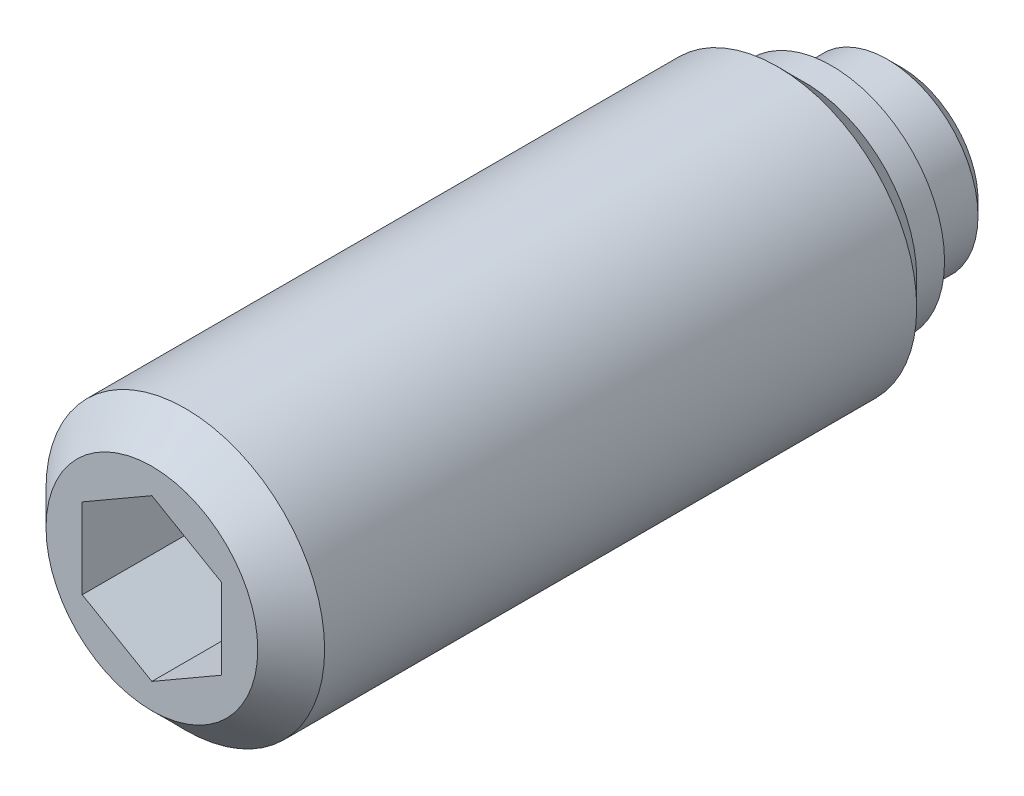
ISO-10303-21;
HEADER;
FILE_DESCRIPTION(('STEP AP214'),'2;1');
FILE_NAME('part.step','',(''),(''),'','','');
FILE_SCHEMA(('AUTOMOTIVE_DESIGN { 1 0 10303 214 1 1 1 1 }'));
ENDSEC;
DATA;
#1=APPLICATION_CONTEXT('core data for automotive mechanical design processes');
#2=APPLICATION_PROTOCOL_DEFINITION('international standard','automotive_design',2000,#1);
#3=PRODUCT_CONTEXT('',#1,'mechanical');
#4=PRODUCT('Part','Part','',(#3));
#5=PRODUCT_RELATED_PRODUCT_CATEGORY('part','',(#4));
#6=PRODUCT_DEFINITION_FORMATION('','',#4);
#7=PRODUCT_DEFINITION_CONTEXT('part definition',#1,'design');
#8=PRODUCT_DEFINITION('design','',#6,#7);
#9=PRODUCT_DEFINITION_SHAPE('','',#8);
#10=(LENGTH_UNIT() NAMED_UNIT(*) SI_UNIT(.MILLI.,.METRE.));
#11=(NAMED_UNIT(*) PLANE_ANGLE_UNIT() SI_UNIT($,.RADIAN.));
#12=(NAMED_UNIT(*) SI_UNIT($,.STERADIAN.) SOLID_ANGLE_UNIT());
#13=UNCERTAINTY_MEASURE_WITH_UNIT(LENGTH_MEASURE(1.E-05),#10,'distance_accuracy_value','');
#14=(GEOMETRIC_REPRESENTATION_CONTEXT(3) GLOBAL_UNCERTAINTY_ASSIGNED_CONTEXT((#13)) GLOBAL_UNIT_ASSIGNED_CONTEXT((#10,
#11,#12)) REPRESENTATION_CONTEXT('',''));
#15=CARTESIAN_POINT('',(0.,0.,0.));
#16=DIRECTION('',(0.,0.,1.));
#17=DIRECTION('',(1.,0.,0.));
#18=AXIS2_PLACEMENT_3D('',#15,#16,#17);
#19=CARTESIAN_POINT('',(0.,0.,0.));
#20=DIRECTION('',(0.,0.,-1.));
#21=DIRECTION('',(-1.,0.,0.));
#22=AXIS2_PLACEMENT_3D('',#19,#20,#21);
#23=CYLINDRICAL_SURFACE('',#22,3.25);
#24=CARTESIAN_POINT('',(0.,0.,0.5));
#25=DIRECTION('',(0.,0.,-1.));
#26=DIRECTION('',(-1.,0.,0.));
#27=AXIS2_PLACEMENT_3D('',#24,#25,#26);
#28=CIRCLE('',#27,3.25);
#29=CARTESIAN_POINT('',(-3.25,0.,0.5));
#30=VERTEX_POINT('',#29);
#31=EDGE_CURVE('E133',#30,#30,#28,.T.);
#32=ORIENTED_EDGE('',*,*,#31,.F.);
#33=EDGE_LOOP('',(#32));
#34=FACE_BOUND('',#33,.T.);
#35=CARTESIAN_POINT('',(0.,0.,2.5));
#36=DIRECTION('',(0.,0.,-1.));
#37=DIRECTION('',(-1.,0.,0.));
#38=AXIS2_PLACEMENT_3D('',#35,#36,#37);
#39=CIRCLE('',#38,3.25);
#40=CARTESIAN_POINT('',(-3.25,0.,2.5));
#41=VERTEX_POINT('',#40);
#42=EDGE_CURVE('E127',#41,#41,#39,.T.);
#43=ORIENTED_EDGE('',*,*,#42,.T.);
#44=EDGE_LOOP('',(#43));
#45=FACE_BOUND('',#44,.T.);
#46=ADVANCED_FACE('F14',(#34,#45),#23,.T.);
#47=CARTESIAN_POINT('',(0.,0.,0.5));
#48=DIRECTION('',(0.,0.,1.));
#49=DIRECTION('',(1.,0.,0.));
#50=AXIS2_PLACEMENT_3D('',#47,#48,#49);
#51=CONICAL_SURFACE('',#50,3.25,0.785398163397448);
#52=CARTESIAN_POINT('',(0.,0.,0.));
#53=DIRECTION('',(0.,0.,-1.));
#54=DIRECTION('',(-1.,0.,0.));
#55=AXIS2_PLACEMENT_3D('',#52,#53,#54);
#56=CIRCLE('',#55,2.75);
#57=CARTESIAN_POINT('',(-2.75,0.,0.));
#58=VERTEX_POINT('',#57);
#59=EDGE_CURVE('E130',#58,#58,#56,.T.);
#60=ORIENTED_EDGE('',*,*,#59,.F.);
#61=EDGE_LOOP('',(#60));
#62=FACE_BOUND('',#61,.T.);
#63=ORIENTED_EDGE('',*,*,#31,.T.);
#64=EDGE_LOOP('',(#63));
#65=FACE_BOUND('',#64,.T.);
#66=ADVANCED_FACE('F159',(#62,#65),#51,.T.);
#67=CARTESIAN_POINT('',(0.,2.75,0.));
#68=DIRECTION('',(0.,0.,1.));
#69=DIRECTION('',(1.,0.,0.));
#70=AXIS2_PLACEMENT_3D('',#67,#68,#69);
#71=PLANE('',#70);
#72=ORIENTED_EDGE('',*,*,#59,.T.);
#73=EDGE_LOOP('',(#72));
#74=FACE_BOUND('',#73,.T.);
#75=ADVANCED_FACE('F165',(#74),#71,.F.);
#76=CARTESIAN_POINT('',(0.,0.,2.5));
#77=DIRECTION('',(0.,0.,-1.));
#78=DIRECTION('',(-1.,0.,0.));
#79=AXIS2_PLACEMENT_3D('',#76,#77,#78);
#80=CYLINDRICAL_SURFACE('',#79,5.);
#81=CARTESIAN_POINT('',(0.,0.,4.45));
#82=DIRECTION('',(0.,0.,-1.));
#83=DIRECTION('',(-1.,0.,0.));
#84=AXIS2_PLACEMENT_3D('',#81,#82,#83);
#85=CIRCLE('',#84,5.);
#86=CARTESIAN_POINT('',(-5.,0.,4.45));
#87=VERTEX_POINT('',#86);
#88=EDGE_CURVE('E9',#87,#87,#85,.T.);
#89=ORIENTED_EDGE('',*,*,#88,.F.);
#90=EDGE_LOOP('',(#89));
#91=FACE_BOUND('',#90,.T.);
#92=CARTESIAN_POINT('',(0.,0.,25.7));
#93=DIRECTION('',(0.,0.,1.));
#94=DIRECTION('',(1.,0.,0.));
#95=AXIS2_PLACEMENT_3D('',#92,#93,#94);
#96=CIRCLE('',#95,5.);
#97=CARTESIAN_POINT('',(5.,0.,25.7));
#98=VERTEX_POINT('',#97);
#99=EDGE_CURVE('E124',#98,#98,#96,.T.);
#100=ORIENTED_EDGE('',*,*,#99,.F.);
#101=EDGE_LOOP('',(#100));
#102=FACE_BOUND('',#101,.T.);
#103=ADVANCED_FACE('F16',(#91,#102),#80,.T.);
#104=CARTESIAN_POINT('',(0.,4.05,2.5));
#105=DIRECTION('',(0.,0.,1.));
#106=DIRECTION('',(1.,0.,0.));
#107=AXIS2_PLACEMENT_3D('',#104,#105,#106);
#108=PLANE('',#107);
#109=CARTESIAN_POINT('',(0.,0.,2.5));
#110=DIRECTION('',(0.,0.,-1.));
#111=DIRECTION('',(-1.,0.,0.));
#112=AXIS2_PLACEMENT_3D('',#109,#110,#111);
#113=CIRCLE('',#112,4.05);
#114=CARTESIAN_POINT('',(-4.05,0.,2.5));
#115=VERTEX_POINT('',#114);
#116=EDGE_CURVE('E136',#115,#115,#113,.T.);
#117=ORIENTED_EDGE('',*,*,#116,.T.);
#118=EDGE_LOOP('',(#117));
#119=FACE_BOUND('',#118,.T.);
#120=ORIENTED_EDGE('',*,*,#42,.F.);
#121=EDGE_LOOP('',(#120));
#122=FACE_BOUND('',#121,.T.);
#123=ADVANCED_FACE('F156',(#119,#122),#108,.F.);
#124=CARTESIAN_POINT('',(0.,0.,2.5));
#125=DIRECTION('',(0.,0.,-1.));
#126=DIRECTION('',(-1.,0.,0.));
#127=AXIS2_PLACEMENT_3D('',#124,#125,#126);
#128=CYLINDRICAL_SURFACE('',#127,4.05);
#129=CARTESIAN_POINT('',(0.,0.,3.5));
#130=DIRECTION('',(0.,0.,-1.));
#131=DIRECTION('',(-1.,0.,0.));
#132=AXIS2_PLACEMENT_3D('',#129,#130,#131);
#133=CIRCLE('',#132,4.05);
#134=CARTESIAN_POINT('',(-4.05,0.,3.5));
#135=VERTEX_POINT('',#134);
#136=EDGE_CURVE('E22',#135,#135,#133,.T.);
#137=ORIENTED_EDGE('',*,*,#136,.T.);
#138=EDGE_LOOP('',(#137));
#139=FACE_BOUND('',#138,.T.);
#140=ORIENTED_EDGE('',*,*,#116,.F.);
#141=EDGE_LOOP('',(#140));
#142=FACE_BOUND('',#141,.T.);
#143=ADVANCED_FACE('F141',(#139,#142),#128,.T.);
#144=CARTESIAN_POINT('',(0.,0.,4.45));
#145=DIRECTION('',(0.,0.,1.));
#146=DIRECTION('',(1.,0.,0.));
#147=AXIS2_PLACEMENT_3D('',#144,#145,#146);
#148=CONICAL_SURFACE('',#147,5.,0.785398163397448);
#149=ORIENTED_EDGE('',*,*,#88,.T.);
#150=EDGE_LOOP('',(#149));
#151=FACE_BOUND('',#150,.T.);
#152=ORIENTED_EDGE('',*,*,#136,.F.);
#153=EDGE_LOOP('',(#152));
#154=FACE_BOUND('',#153,.T.);
#155=ADVANCED_FACE('F144',(#151,#154),#148,.T.);
#156=CARTESIAN_POINT('',(0.,-3.8,26.9));
#157=DIRECTION('',(0.,0.,1.));
#158=DIRECTION('',(1.,0.,0.));
#159=AXIS2_PLACEMENT_3D('',#156,#157,#158);
#160=PLANE('',#159);
#161=DIRECTION('',(0.866025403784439,-0.5,0.));
#162=VECTOR('',#161,1.);
#163=CARTESIAN_POINT('',(-2.5,-1.44337567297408,26.9));
#164=LINE('',#163,#162);
#165=CARTESIAN_POINT('',(-2.5,-1.44337567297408,26.9));
#166=VERTEX_POINT('',#165);
#167=CARTESIAN_POINT('',(0.,-2.88675134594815,26.9));
#168=VERTEX_POINT('',#167);
#169=EDGE_CURVE('E29',#166,#168,#164,.T.);
#170=ORIENTED_EDGE('',*,*,#169,.F.);
#171=DIRECTION('',(0.,-1.,0.));
#172=VECTOR('',#171,1.);
#173=CARTESIAN_POINT('',(-2.5,1.44337567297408,26.9));
#174=LINE('',#173,#172);
#175=CARTESIAN_POINT('',(-2.5,1.44337567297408,26.9));
#176=VERTEX_POINT('',#175);
#177=EDGE_CURVE('E112',#176,#166,#174,.T.);
#178=ORIENTED_EDGE('',*,*,#177,.F.);
#179=DIRECTION('',(-0.866025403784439,-0.5,0.));
#180=VECTOR('',#179,1.);
#181=CARTESIAN_POINT('',(0.,2.88675134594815,26.9));
#182=LINE('',#181,#180);
#183=CARTESIAN_POINT('',(0.,2.88675134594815,26.9));
#184=VERTEX_POINT('',#183);
#185=EDGE_CURVE('E110',#184,#176,#182,.T.);
#186=ORIENTED_EDGE('',*,*,#185,.F.);
#187=DIRECTION('',(-0.866025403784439,0.5,0.));
#188=VECTOR('',#187,1.);
#189=CARTESIAN_POINT('',(2.5,1.44337567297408,26.9));
#190=LINE('',#189,#188);
#191=CARTESIAN_POINT('',(2.5,1.44337567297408,26.9));
#192=VERTEX_POINT('',#191);
#193=EDGE_CURVE('E77',#192,#184,#190,.T.);
#194=ORIENTED_EDGE('',*,*,#193,.F.);
#195=DIRECTION('',(0.,1.,0.));
#196=VECTOR('',#195,1.);
#197=CARTESIAN_POINT('',(2.5,-1.44337567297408,26.9));
#198=LINE('',#197,#196);
#199=CARTESIAN_POINT('',(2.5,-1.44337567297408,26.9));
#200=VERTEX_POINT('',#199);
#201=EDGE_CURVE('E106',#200,#192,#198,.T.);
#202=ORIENTED_EDGE('',*,*,#201,.F.);
#203=DIRECTION('',(0.866025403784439,0.5,0.));
#204=VECTOR('',#203,1.);
#205=CARTESIAN_POINT('',(0.,-2.88675134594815,26.9));
#206=LINE('',#205,#204);
#207=EDGE_CURVE('E103',#168,#200,#206,.T.);
#208=ORIENTED_EDGE('',*,*,#207,.F.);
#209=EDGE_LOOP('',(#170,#178,#186,#194,#202,#208));
#210=FACE_BOUND('',#209,.T.);
#211=CARTESIAN_POINT('',(0.,0.,26.9));
#212=DIRECTION('',(0.,0.,1.));
#213=DIRECTION('',(1.,0.,0.));
#214=AXIS2_PLACEMENT_3D('',#211,#212,#213);
#215=CIRCLE('',#214,3.8);
#216=CARTESIAN_POINT('',(3.8,0.,26.9));
#217=VERTEX_POINT('',#216);
#218=EDGE_CURVE('E116',#217,#217,#215,.T.);
#219=ORIENTED_EDGE('',*,*,#218,.T.);
#220=EDGE_LOOP('',(#219));
#221=FACE_BOUND('',#220,.T.);
#222=ADVANCED_FACE('F146',(#210,#221),#160,.T.);
#223=CARTESIAN_POINT('',(0.,0.,26.9));
#224=DIRECTION('',(0.,0.,-1.));
#225=DIRECTION('',(-1.,0.,0.));
#226=AXIS2_PLACEMENT_3D('',#223,#224,#225);
#227=CONICAL_SURFACE('',#226,3.8,0.785398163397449);
#228=ORIENTED_EDGE('',*,*,#99,.T.);
#229=EDGE_LOOP('',(#228));
#230=FACE_BOUND('',#229,.T.);
#231=ORIENTED_EDGE('',*,*,#218,.F.);
#232=EDGE_LOOP('',(#231));
#233=FACE_BOUND('',#232,.T.);
#234=ADVANCED_FACE('F153',(#230,#233),#227,.T.);
#235=CARTESIAN_POINT('',(-2.5,-1.44337567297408,20.9));
#236=DIRECTION('',(-0.5,-0.866025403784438,0.));
#237=DIRECTION('',(0.866025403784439,-0.5,0.));
#238=AXIS2_PLACEMENT_3D('',#235,#236,#237);
#239=PLANE('',#238);
#240=ORIENTED_EDGE('',*,*,#169,.T.);
#241=DIRECTION('',(0.,0.,1.));
#242=VECTOR('',#241,1.);
#243=CARTESIAN_POINT('',(0.,-2.88675134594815,20.9));
#244=LINE('',#243,#242);
#245=CARTESIAN_POINT('',(0.,-2.88675134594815,20.9));
#246=VERTEX_POINT('',#245);
#247=EDGE_CURVE('E59',#246,#168,#244,.T.);
#248=ORIENTED_EDGE('',*,*,#247,.F.);
#249=DIRECTION('',(0.866025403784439,-0.5,0.));
#250=VECTOR('',#249,1.);
#251=CARTESIAN_POINT('',(-2.5,-1.44337567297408,20.9));
#252=LINE('',#251,#250);
#253=CARTESIAN_POINT('',(-2.5,-1.44337567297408,20.9));
#254=VERTEX_POINT('',#253);
#255=EDGE_CURVE('E114',#254,#246,#252,.T.);
#256=ORIENTED_EDGE('',*,*,#255,.F.);
#257=DIRECTION('',(0.,0.,1.));
#258=VECTOR('',#257,1.);
#259=CARTESIAN_POINT('',(-2.5,-1.44337567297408,20.9));
#260=LINE('',#259,#258);
#261=EDGE_CURVE('E37',#254,#166,#260,.T.);
#262=ORIENTED_EDGE('',*,*,#261,.T.);
#263=EDGE_LOOP('',(#240,#248,#256,#262));
#264=FACE_BOUND('',#263,.T.);
#265=ADVANCED_FACE('F191',(#264),#239,.F.);
#266=CARTESIAN_POINT('',(-2.5,1.44337567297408,20.9));
#267=DIRECTION('',(-1.,0.,0.));
#268=DIRECTION('',(0.,0.,1.));
#269=AXIS2_PLACEMENT_3D('',#266,#267,#268);
#270=PLANE('',#269);
#271=ORIENTED_EDGE('',*,*,#177,.T.);
#272=ORIENTED_EDGE('',*,*,#261,.F.);
#273=DIRECTION('',(0.,-1.,0.));
#274=VECTOR('',#273,1.);
#275=CARTESIAN_POINT('',(-2.5,1.44337567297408,20.9));
#276=LINE('',#275,#274);
#277=CARTESIAN_POINT('',(-2.5,1.44337567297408,20.9));
#278=VERTEX_POINT('',#277);
#279=EDGE_CURVE('E89',#278,#254,#276,.T.);
#280=ORIENTED_EDGE('',*,*,#279,.F.);
#281=DIRECTION('',(0.,0.,1.));
#282=VECTOR('',#281,1.);
#283=CARTESIAN_POINT('',(-2.5,1.44337567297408,20.9));
#284=LINE('',#283,#282);
#285=EDGE_CURVE('E81',#278,#176,#284,.T.);
#286=ORIENTED_EDGE('',*,*,#285,.T.);
#287=EDGE_LOOP('',(#271,#272,#280,#286));
#288=FACE_BOUND('',#287,.T.);
#289=ADVANCED_FACE('F198',(#288),#270,.F.);
#290=CARTESIAN_POINT('',(0.,2.88675134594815,20.9));
#291=DIRECTION('',(-0.5,0.866025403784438,0.));
#292=DIRECTION('',(-0.866025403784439,-0.5,0.));
#293=AXIS2_PLACEMENT_3D('',#290,#291,#292);
#294=PLANE('',#293);
#295=ORIENTED_EDGE('',*,*,#185,.T.);
#296=ORIENTED_EDGE('',*,*,#285,.F.);
#297=DIRECTION('',(-0.866025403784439,-0.5,0.));
#298=VECTOR('',#297,1.);
#299=CARTESIAN_POINT('',(0.,2.88675134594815,20.9));
#300=LINE('',#299,#298);
#301=CARTESIAN_POINT('',(0.,2.88675134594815,20.9));
#302=VERTEX_POINT('',#301);
#303=EDGE_CURVE('E85',#302,#278,#300,.T.);
#304=ORIENTED_EDGE('',*,*,#303,.F.);
#305=DIRECTION('',(0.,0.,1.));
#306=VECTOR('',#305,1.);
#307=CARTESIAN_POINT('',(0.,2.88675134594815,20.9));
#308=LINE('',#307,#306);
#309=EDGE_CURVE('E70',#302,#184,#308,.T.);
#310=ORIENTED_EDGE('',*,*,#309,.T.);
#311=EDGE_LOOP('',(#295,#296,#304,#310));
#312=FACE_BOUND('',#311,.T.);
#313=ADVANCED_FACE('F86',(#312),#294,.F.);
#314=CARTESIAN_POINT('',(2.5,1.44337567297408,20.9));
#315=DIRECTION('',(0.5,0.866025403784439,0.));
#316=DIRECTION('',(-0.866025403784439,0.5,0.));
#317=AXIS2_PLACEMENT_3D('',#314,#315,#316);
#318=PLANE('',#317);
#319=ORIENTED_EDGE('',*,*,#193,.T.);
#320=ORIENTED_EDGE('',*,*,#309,.F.);
#321=DIRECTION('',(-0.866025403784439,0.5,0.));
#322=VECTOR('',#321,1.);
#323=CARTESIAN_POINT('',(2.5,1.44337567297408,20.9));
#324=LINE('',#323,#322);
#325=CARTESIAN_POINT('',(2.5,1.44337567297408,20.9));
#326=VERTEX_POINT('',#325);
#327=EDGE_CURVE('E74',#326,#302,#324,.T.);
#328=ORIENTED_EDGE('',*,*,#327,.F.);
#329=DIRECTION('',(0.,0.,1.));
#330=VECTOR('',#329,1.);
#331=CARTESIAN_POINT('',(2.5,1.44337567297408,20.9));
#332=LINE('',#331,#330);
#333=EDGE_CURVE('E82',#326,#192,#332,.T.);
#334=ORIENTED_EDGE('',*,*,#333,.T.);
#335=EDGE_LOOP('',(#319,#320,#328,#334));
#336=FACE_BOUND('',#335,.T.);
#337=ADVANCED_FACE('F72',(#336),#318,.F.);
#338=CARTESIAN_POINT('',(2.5,-1.44337567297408,20.9));
#339=DIRECTION('',(1.,0.,0.));
#340=DIRECTION('',(0.,1.,0.));
#341=AXIS2_PLACEMENT_3D('',#338,#339,#340);
#342=PLANE('',#341);
#343=ORIENTED_EDGE('',*,*,#201,.T.);
#344=ORIENTED_EDGE('',*,*,#333,.F.);
#345=DIRECTION('',(0.,1.,0.));
#346=VECTOR('',#345,1.);
#347=CARTESIAN_POINT('',(2.5,-1.44337567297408,20.9));
#348=LINE('',#347,#346);
#349=CARTESIAN_POINT('',(2.5,-1.44337567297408,20.9));
#350=VERTEX_POINT('',#349);
#351=EDGE_CURVE('E95',#350,#326,#348,.T.);
#352=ORIENTED_EDGE('',*,*,#351,.F.);
#353=DIRECTION('',(0.,0.,1.));
#354=VECTOR('',#353,1.);
#355=CARTESIAN_POINT('',(2.5,-1.44337567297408,20.9));
#356=LINE('',#355,#354);
#357=EDGE_CURVE('E119',#350,#200,#356,.T.);
#358=ORIENTED_EDGE('',*,*,#357,.T.);
#359=EDGE_LOOP('',(#343,#344,#352,#358));
#360=FACE_BOUND('',#359,.T.);
#361=ADVANCED_FACE('F204',(#360),#342,.F.);
#362=CARTESIAN_POINT('',(0.,-2.88675134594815,20.9));
#363=DIRECTION('',(0.5,-0.866025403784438,0.));
#364=DIRECTION('',(0.866025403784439,0.5,0.));
#365=AXIS2_PLACEMENT_3D('',#362,#363,#364);
#366=PLANE('',#365);
#367=ORIENTED_EDGE('',*,*,#207,.T.);
#368=ORIENTED_EDGE('',*,*,#357,.F.);
#369=DIRECTION('',(0.866025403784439,0.5,0.));
#370=VECTOR('',#369,1.);
#371=CARTESIAN_POINT('',(0.,-2.88675134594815,20.9));
#372=LINE('',#371,#370);
#373=EDGE_CURVE('E97',#246,#350,#372,.T.);
#374=ORIENTED_EDGE('',*,*,#373,.F.);
#375=ORIENTED_EDGE('',*,*,#247,.T.);
#376=EDGE_LOOP('',(#367,#368,#374,#375));
#377=FACE_BOUND('',#376,.T.);
#378=ADVANCED_FACE('F201',(#377),#366,.F.);
#379=CARTESIAN_POINT('',(0.,0.,20.9));
#380=DIRECTION('',(0.,0.,1.));
#381=DIRECTION('',(1.,0.,0.));
#382=AXIS2_PLACEMENT_3D('',#379,#380,#381);
#383=PLANE('',#382);
#384=ORIENTED_EDGE('',*,*,#255,.T.);
#385=ORIENTED_EDGE('',*,*,#373,.T.);
#386=ORIENTED_EDGE('',*,*,#351,.T.);
#387=ORIENTED_EDGE('',*,*,#327,.T.);
#388=ORIENTED_EDGE('',*,*,#303,.T.);
#389=ORIENTED_EDGE('',*,*,#279,.T.);
#390=EDGE_LOOP('',(#384,#385,#386,#387,#388,#389));
#391=FACE_BOUND('',#390,.T.);
#392=ADVANCED_FACE('F92',(#391),#383,.T.);
#393=CLOSED_SHELL('',(#46,#66,#75,#103,#123,#143,#155,#222,#234,#265,#289,#313,#337,#361,#378,#392));
#394=MANIFOLD_SOLID_BREP('B1',#393);
#395=ADVANCED_BREP_SHAPE_REPRESENTATION('',(#18,#394),#14);
#396=SHAPE_DEFINITION_REPRESENTATION(#9,#395);
ENDSEC;
END-ISO-10303-21;
